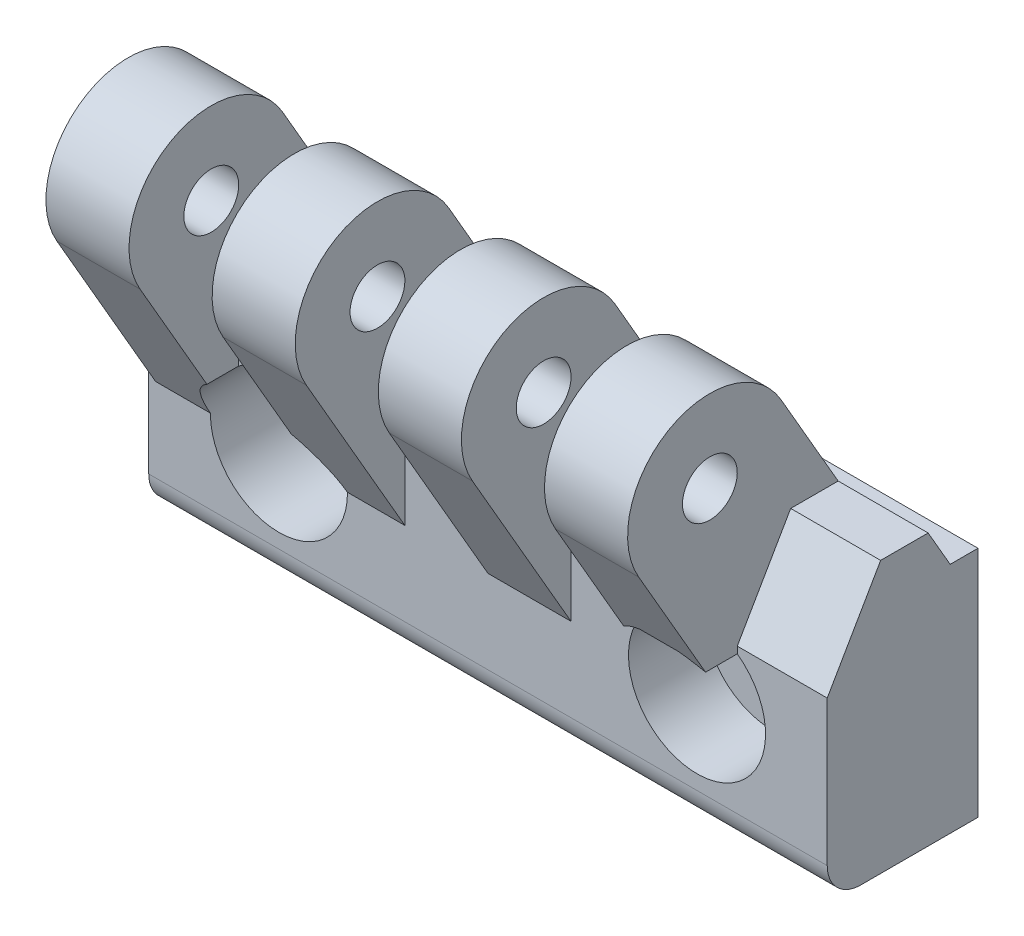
ISO-10303-21;
HEADER;
FILE_DESCRIPTION(('STEP AP214'),'2;1');
FILE_NAME('part.step','',(''),(''),'','','');
FILE_SCHEMA(('AUTOMOTIVE_DESIGN { 1 0 10303 214 1 1 1 1 }'));
ENDSEC;
DATA;
#1=APPLICATION_CONTEXT('core data for automotive mechanical design processes');
#2=APPLICATION_PROTOCOL_DEFINITION('international standard','automotive_design',2000,#1);
#3=PRODUCT_CONTEXT('',#1,'mechanical');
#4=PRODUCT('Part','Part','',(#3));
#5=PRODUCT_RELATED_PRODUCT_CATEGORY('part','',(#4));
#6=PRODUCT_DEFINITION_FORMATION('','',#4);
#7=PRODUCT_DEFINITION_CONTEXT('part definition',#1,'design');
#8=PRODUCT_DEFINITION('design','',#6,#7);
#9=PRODUCT_DEFINITION_SHAPE('','',#8);
#10=(LENGTH_UNIT() NAMED_UNIT(*) SI_UNIT(.MILLI.,.METRE.));
#11=(NAMED_UNIT(*) PLANE_ANGLE_UNIT() SI_UNIT($,.RADIAN.));
#12=(NAMED_UNIT(*) SI_UNIT($,.STERADIAN.) SOLID_ANGLE_UNIT());
#13=UNCERTAINTY_MEASURE_WITH_UNIT(LENGTH_MEASURE(1.E-05),#10,'distance_accuracy_value','');
#14=(GEOMETRIC_REPRESENTATION_CONTEXT(3) GLOBAL_UNCERTAINTY_ASSIGNED_CONTEXT((#13)) GLOBAL_UNIT_ASSIGNED_CONTEXT((#10,
#11,#12)) REPRESENTATION_CONTEXT('',''));
#15=CARTESIAN_POINT('',(0.,0.,0.));
#16=DIRECTION('',(0.,0.,1.));
#17=DIRECTION('',(1.,0.,0.));
#18=AXIS2_PLACEMENT_3D('',#15,#16,#17);
#19=CARTESIAN_POINT('',(40.,4.53553018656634,11.));
#20=DIRECTION('',(0.,0.,-1.));
#21=DIRECTION('',(-1.,0.,0.));
#22=AXIS2_PLACEMENT_3D('',#19,#20,#21);
#23=PLANE('',#22);
#24=CARTESIAN_POINT('',(0.,0.,11.));
#25=DIRECTION('',(0.,0.,-1.));
#26=DIRECTION('',(-1.,0.,0.));
#27=AXIS2_PLACEMENT_3D('',#24,#25,#26);
#28=CIRCLE('',#27,5.);
#29=CARTESIAN_POINT('',(3.125,3.903123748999,11.));
#30=VERTEX_POINT('',#29);
#31=CARTESIAN_POINT('',(2.10451085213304,4.53553018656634,11.));
#32=VERTEX_POINT('',#31);
#33=EDGE_CURVE('E1015',#30,#32,#28,.F.);
#34=ORIENTED_EDGE('',*,*,#33,.F.);
#35=DIRECTION('',(0.,-1.,0.));
#36=VECTOR('',#35,1.);
#37=CARTESIAN_POINT('',(3.125,4.53553018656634,11.));
#38=LINE('',#37,#36);
#39=CARTESIAN_POINT('',(3.125,4.53553018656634,11.));
#40=VERTEX_POINT('',#39);
#41=EDGE_CURVE('E461',#40,#30,#38,.T.);
#42=ORIENTED_EDGE('',*,*,#41,.F.);
#43=DIRECTION('',(-1.,0.,0.));
#44=VECTOR('',#43,1.);
#45=CARTESIAN_POINT('',(40.,4.53553018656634,11.));
#46=LINE('',#45,#44);
#47=EDGE_CURVE('E560',#40,#32,#46,.T.);
#48=ORIENTED_EDGE('',*,*,#47,.T.);
#49=EDGE_LOOP('',(#34,#42,#48));
#50=FACE_BOUND('',#49,.T.);
#51=ADVANCED_FACE('F14',(#50),#23,.F.);
#52=CARTESIAN_POINT('',(-2.104510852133,4.53553018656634,11.));
#53=VERTEX_POINT('',#52);
#54=CARTESIAN_POINT('',(-2.9375,4.04612082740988,11.));
#55=VERTEX_POINT('',#54);
#56=EDGE_CURVE('E29',#53,#55,#28,.F.);
#57=ORIENTED_EDGE('',*,*,#56,.F.);
#58=CARTESIAN_POINT('',(-2.9375,4.53553018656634,11.));
#59=VERTEX_POINT('',#58);
#60=EDGE_CURVE('E424',#53,#59,#46,.T.);
#61=ORIENTED_EDGE('',*,*,#60,.T.);
#62=DIRECTION('',(0.,-1.,0.));
#63=VECTOR('',#62,1.);
#64=CARTESIAN_POINT('',(-2.9375,4.53553018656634,11.));
#65=LINE('',#64,#63);
#66=EDGE_CURVE('E288',#59,#55,#65,.T.);
#67=ORIENTED_EDGE('',*,*,#66,.T.);
#68=EDGE_LOOP('',(#57,#61,#67));
#69=FACE_BOUND('',#68,.T.);
#70=ADVANCED_FACE('F678',(#69),#23,.F.);
#71=CARTESIAN_POINT('',(3.125,15.5,13.));
#72=DIRECTION('',(1.,0.,0.));
#73=DIRECTION('',(0.,1.,0.));
#74=AXIS2_PLACEMENT_3D('',#71,#72,#73);
#75=PLANE('',#74);
#76=CARTESIAN_POINT('',(3.125,15.5,13.));
#77=DIRECTION('',(1.,0.,0.));
#78=DIRECTION('',(0.,1.,0.));
#79=AXIS2_PLACEMENT_3D('',#76,#77,#78);
#80=CIRCLE('',#79,2.);
#81=CARTESIAN_POINT('',(3.125,17.5,13.));
#82=VERTEX_POINT('',#81);
#83=EDGE_CURVE('E313',#82,#82,#80,.T.);
#84=ORIENTED_EDGE('',*,*,#83,.T.);
#85=EDGE_LOOP('',(#84));
#86=FACE_BOUND('',#85,.T.);
#87=DIRECTION('',(0.,0.,-1.));
#88=VECTOR('',#87,1.);
#89=CARTESIAN_POINT('',(3.125,3.903123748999,0.));
#90=LINE('',#89,#88);
#91=CARTESIAN_POINT('',(3.125,3.903123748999,13.2327436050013));
#92=VERTEX_POINT('',#91);
#93=EDGE_CURVE('E652',#92,#30,#90,.T.);
#94=ORIENTED_EDGE('',*,*,#93,.F.);
#95=DIRECTION('',(0.,-0.866025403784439,-0.5));
#96=VECTOR('',#95,1.);
#97=CARTESIAN_POINT('',(3.125,12.5,18.1961524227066));
#98=LINE('',#97,#96);
#99=CARTESIAN_POINT('',(3.125,12.5,18.1961524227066));
#100=VERTEX_POINT('',#99);
#101=EDGE_CURVE('E310',#100,#92,#98,.T.);
#102=ORIENTED_EDGE('',*,*,#101,.F.);
#103=CARTESIAN_POINT('',(3.125,15.5,13.));
#104=DIRECTION('',(1.,0.,0.));
#105=DIRECTION('',(0.,1.,0.));
#106=AXIS2_PLACEMENT_3D('',#103,#104,#105);
#107=CIRCLE('',#106,6.);
#108=CARTESIAN_POINT('',(3.125,18.5,7.80384757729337));
#109=VERTEX_POINT('',#108);
#110=EDGE_CURVE('E306',#109,#100,#107,.T.);
#111=ORIENTED_EDGE('',*,*,#110,.F.);
#112=DIRECTION('',(0.,0.866025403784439,0.5));
#113=VECTOR('',#112,1.);
#114=CARTESIAN_POINT('',(3.125,6.71539030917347,1.));
#115=LINE('',#114,#113);
#116=CARTESIAN_POINT('',(3.125,11.2857142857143,3.63867777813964));
#117=VERTEX_POINT('',#116);
#118=EDGE_CURVE('E304',#117,#109,#115,.T.);
#119=ORIENTED_EDGE('',*,*,#118,.F.);
#120=DIRECTION('',(0.,0.,1.));
#121=VECTOR('',#120,1.);
#122=CARTESIAN_POINT('',(3.125,11.2857142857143,3.63867777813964));
#123=LINE('',#122,#121);
#124=CARTESIAN_POINT('',(3.125,11.2857142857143,7.1027793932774));
#125=VERTEX_POINT('',#124);
#126=EDGE_CURVE('E337',#117,#125,#123,.T.);
#127=ORIENTED_EDGE('',*,*,#126,.T.);
#128=DIRECTION('',(0.,-0.866025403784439,0.5));
#129=VECTOR('',#128,1.);
#130=CARTESIAN_POINT('',(3.125,11.2857142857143,7.1027793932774));
#131=LINE('',#130,#129);
#132=EDGE_CURVE('E335',#125,#40,#131,.T.);
#133=ORIENTED_EDGE('',*,*,#132,.T.);
#134=ORIENTED_EDGE('',*,*,#41,.T.);
#135=EDGE_LOOP('',(#94,#102,#111,#119,#127,#133,#134));
#136=FACE_BOUND('',#135,.T.);
#137=ADVANCED_FACE('F651',(#86,#136),#75,.F.);
#138=CARTESIAN_POINT('',(-2.9375,15.5,13.));
#139=DIRECTION('',(1.,0.,0.));
#140=DIRECTION('',(0.,1.,0.));
#141=AXIS2_PLACEMENT_3D('',#138,#139,#140);
#142=PLANE('',#141);
#143=CARTESIAN_POINT('',(-2.9375,15.5,13.));
#144=DIRECTION('',(1.,0.,0.));
#145=DIRECTION('',(0.,1.,0.));
#146=AXIS2_PLACEMENT_3D('',#143,#144,#145);
#147=CIRCLE('',#146,2.);
#148=CARTESIAN_POINT('',(-2.9375,17.5,13.));
#149=VERTEX_POINT('',#148);
#150=EDGE_CURVE('E273',#149,#149,#147,.T.);
#151=ORIENTED_EDGE('',*,*,#150,.F.);
#152=EDGE_LOOP('',(#151));
#153=FACE_BOUND('',#152,.T.);
#154=DIRECTION('',(0.,-0.866025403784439,-0.5));
#155=VECTOR('',#154,1.);
#156=CARTESIAN_POINT('',(-2.9375,12.5,18.1961524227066));
#157=LINE('',#156,#155);
#158=CARTESIAN_POINT('',(-2.9375,12.5,18.1961524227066));
#159=VERTEX_POINT('',#158);
#160=CARTESIAN_POINT('',(-2.9375,4.04612082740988,13.3153030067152));
#161=VERTEX_POINT('',#160);
#162=EDGE_CURVE('E263',#159,#161,#157,.T.);
#163=ORIENTED_EDGE('',*,*,#162,.T.);
#164=DIRECTION('',(0.,0.,-1.));
#165=VECTOR('',#164,1.);
#166=CARTESIAN_POINT('',(-2.9375,4.04612082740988,0.));
#167=LINE('',#166,#165);
#168=EDGE_CURVE('E9',#161,#55,#167,.T.);
#169=ORIENTED_EDGE('',*,*,#168,.T.);
#170=ORIENTED_EDGE('',*,*,#66,.F.);
#171=DIRECTION('',(0.,-0.866025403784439,0.5));
#172=VECTOR('',#171,1.);
#173=CARTESIAN_POINT('',(-2.9375,11.2857142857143,7.1027793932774));
#174=LINE('',#173,#172);
#175=CARTESIAN_POINT('',(-2.9375,11.2857142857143,7.1027793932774));
#176=VERTEX_POINT('',#175);
#177=EDGE_CURVE('E290',#176,#59,#174,.T.);
#178=ORIENTED_EDGE('',*,*,#177,.F.);
#179=DIRECTION('',(0.,0.,1.));
#180=VECTOR('',#179,1.);
#181=CARTESIAN_POINT('',(-2.9375,11.2857142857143,3.63867777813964));
#182=LINE('',#181,#180);
#183=CARTESIAN_POINT('',(-2.9375,11.2857142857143,3.63867777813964));
#184=VERTEX_POINT('',#183);
#185=EDGE_CURVE('E293',#184,#176,#182,.T.);
#186=ORIENTED_EDGE('',*,*,#185,.F.);
#187=DIRECTION('',(0.,0.866025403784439,0.5));
#188=VECTOR('',#187,1.);
#189=CARTESIAN_POINT('',(-2.9375,6.71539030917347,1.));
#190=LINE('',#189,#188);
#191=CARTESIAN_POINT('',(-2.9375,18.5,7.80384757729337));
#192=VERTEX_POINT('',#191);
#193=EDGE_CURVE('E278',#184,#192,#190,.T.);
#194=ORIENTED_EDGE('',*,*,#193,.T.);
#195=CARTESIAN_POINT('',(-2.9375,15.5,13.));
#196=DIRECTION('',(1.,0.,0.));
#197=DIRECTION('',(0.,1.,0.));
#198=AXIS2_PLACEMENT_3D('',#195,#196,#197);
#199=CIRCLE('',#198,6.);
#200=EDGE_CURVE('E272',#192,#159,#199,.T.);
#201=ORIENTED_EDGE('',*,*,#200,.T.);
#202=EDGE_LOOP('',(#163,#169,#170,#178,#186,#194,#201));
#203=FACE_BOUND('',#202,.T.);
#204=ADVANCED_FACE('F270',(#153,#203),#142,.T.);
#205=CARTESIAN_POINT('',(33.4375,15.5,13.));
#206=DIRECTION('',(1.,0.,0.));
#207=DIRECTION('',(0.,1.,0.));
#208=AXIS2_PLACEMENT_3D('',#205,#206,#207);
#209=PLANE('',#208);
#210=CARTESIAN_POINT('',(33.4375,15.5,13.));
#211=DIRECTION('',(1.,0.,0.));
#212=DIRECTION('',(0.,1.,0.));
#213=AXIS2_PLACEMENT_3D('',#210,#211,#212);
#214=CIRCLE('',#213,2.);
#215=CARTESIAN_POINT('',(33.4375,17.5,13.));
#216=VERTEX_POINT('',#215);
#217=EDGE_CURVE('E508',#216,#216,#214,.T.);
#218=ORIENTED_EDGE('',*,*,#217,.F.);
#219=EDGE_LOOP('',(#218));
#220=FACE_BOUND('',#219,.T.);
#221=DIRECTION('',(0.,-0.866025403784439,-0.5));
#222=VECTOR('',#221,1.);
#223=CARTESIAN_POINT('',(33.4375,12.5,18.1961524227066));
#224=LINE('',#223,#222);
#225=CARTESIAN_POINT('',(33.4375,12.5,18.1961524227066));
#226=VERTEX_POINT('',#225);
#227=CARTESIAN_POINT('',(33.4375,4.04612082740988,13.3153030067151));
#228=VERTEX_POINT('',#227);
#229=EDGE_CURVE('E506',#226,#228,#224,.T.);
#230=ORIENTED_EDGE('',*,*,#229,.T.);
#231=DIRECTION('',(0.,0.,-1.));
#232=VECTOR('',#231,1.);
#233=CARTESIAN_POINT('',(33.4375,4.04612082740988,0.));
#234=LINE('',#233,#232);
#235=CARTESIAN_POINT('',(33.4375,4.04612082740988,11.));
#236=VERTEX_POINT('',#235);
#237=EDGE_CURVE('E489',#228,#236,#234,.T.);
#238=ORIENTED_EDGE('',*,*,#237,.T.);
#239=DIRECTION('',(0.,-1.,0.));
#240=VECTOR('',#239,1.);
#241=CARTESIAN_POINT('',(33.4375,4.53553018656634,11.));
#242=LINE('',#241,#240);
#243=CARTESIAN_POINT('',(33.4375,4.53553018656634,11.));
#244=VERTEX_POINT('',#243);
#245=EDGE_CURVE('E528',#244,#236,#242,.T.);
#246=ORIENTED_EDGE('',*,*,#245,.F.);
#247=DIRECTION('',(0.,-0.866025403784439,0.5));
#248=VECTOR('',#247,1.);
#249=CARTESIAN_POINT('',(33.4375,11.2857142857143,7.1027793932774));
#250=LINE('',#249,#248);
#251=CARTESIAN_POINT('',(33.4375,11.2857142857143,7.1027793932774));
#252=VERTEX_POINT('',#251);
#253=EDGE_CURVE('E468',#252,#244,#250,.T.);
#254=ORIENTED_EDGE('',*,*,#253,.F.);
#255=DIRECTION('',(0.,0.,1.));
#256=VECTOR('',#255,1.);
#257=CARTESIAN_POINT('',(33.4375,11.2857142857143,3.63867777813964));
#258=LINE('',#257,#256);
#259=CARTESIAN_POINT('',(33.4375,11.2857142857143,3.63867777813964));
#260=VERTEX_POINT('',#259);
#261=EDGE_CURVE('E526',#260,#252,#258,.T.);
#262=ORIENTED_EDGE('',*,*,#261,.F.);
#263=DIRECTION('',(0.,0.866025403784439,0.5));
#264=VECTOR('',#263,1.);
#265=CARTESIAN_POINT('',(33.4375,6.71539030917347,1.));
#266=LINE('',#265,#264);
#267=CARTESIAN_POINT('',(33.4375,18.5,7.80384757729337));
#268=VERTEX_POINT('',#267);
#269=EDGE_CURVE('E501',#260,#268,#266,.T.);
#270=ORIENTED_EDGE('',*,*,#269,.T.);
#271=CARTESIAN_POINT('',(33.4375,15.5,13.));
#272=DIRECTION('',(1.,0.,0.));
#273=DIRECTION('',(0.,1.,0.));
#274=AXIS2_PLACEMENT_3D('',#271,#272,#273);
#275=CIRCLE('',#274,6.);
#276=EDGE_CURVE('E503',#268,#226,#275,.T.);
#277=ORIENTED_EDGE('',*,*,#276,.T.);
#278=EDGE_LOOP('',(#230,#238,#246,#254,#262,#270,#277));
#279=FACE_BOUND('',#278,.T.);
#280=ADVANCED_FACE('F606',(#220,#279),#209,.T.);
#281=CARTESIAN_POINT('',(27.375,15.5,13.));
#282=DIRECTION('',(1.,0.,0.));
#283=DIRECTION('',(0.,1.,0.));
#284=AXIS2_PLACEMENT_3D('',#281,#282,#283);
#285=PLANE('',#284);
#286=CARTESIAN_POINT('',(27.375,15.5,13.));
#287=DIRECTION('',(1.,0.,0.));
#288=DIRECTION('',(0.,1.,0.));
#289=AXIS2_PLACEMENT_3D('',#286,#287,#288);
#290=CIRCLE('',#289,2.);
#291=CARTESIAN_POINT('',(27.375,17.5,13.));
#292=VERTEX_POINT('',#291);
#293=EDGE_CURVE('E504',#292,#292,#290,.T.);
#294=ORIENTED_EDGE('',*,*,#293,.T.);
#295=EDGE_LOOP('',(#294));
#296=FACE_BOUND('',#295,.T.);
#297=DIRECTION('',(0.,0.,-1.));
#298=VECTOR('',#297,1.);
#299=CARTESIAN_POINT('',(27.375,3.903123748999,0.));
#300=LINE('',#299,#298);
#301=CARTESIAN_POINT('',(27.375,3.903123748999,13.2327436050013));
#302=VERTEX_POINT('',#301);
#303=CARTESIAN_POINT('',(27.375,3.903123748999,11.));
#304=VERTEX_POINT('',#303);
#305=EDGE_CURVE('E470',#302,#304,#300,.T.);
#306=ORIENTED_EDGE('',*,*,#305,.F.);
#307=DIRECTION('',(0.,-0.866025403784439,-0.5));
#308=VECTOR('',#307,1.);
#309=CARTESIAN_POINT('',(27.375,12.5,18.1961524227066));
#310=LINE('',#309,#308);
#311=CARTESIAN_POINT('',(27.375,12.5,18.1961524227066));
#312=VERTEX_POINT('',#311);
#313=EDGE_CURVE('E486',#312,#302,#310,.T.);
#314=ORIENTED_EDGE('',*,*,#313,.F.);
#315=CARTESIAN_POINT('',(27.375,15.5,13.));
#316=DIRECTION('',(1.,0.,0.));
#317=DIRECTION('',(0.,1.,0.));
#318=AXIS2_PLACEMENT_3D('',#315,#316,#317);
#319=CIRCLE('',#318,6.);
#320=CARTESIAN_POINT('',(27.375,18.5,7.80384757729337));
#321=VERTEX_POINT('',#320);
#322=EDGE_CURVE('E492',#321,#312,#319,.T.);
#323=ORIENTED_EDGE('',*,*,#322,.F.);
#324=DIRECTION('',(0.,0.866025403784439,0.5));
#325=VECTOR('',#324,1.);
#326=CARTESIAN_POINT('',(27.375,6.71539030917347,1.));
#327=LINE('',#326,#325);
#328=CARTESIAN_POINT('',(27.375,11.2857142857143,3.63867777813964));
#329=VERTEX_POINT('',#328);
#330=EDGE_CURVE('E491',#329,#321,#327,.T.);
#331=ORIENTED_EDGE('',*,*,#330,.F.);
#332=DIRECTION('',(0.,0.,1.));
#333=VECTOR('',#332,1.);
#334=CARTESIAN_POINT('',(27.375,11.2857142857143,3.63867777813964));
#335=LINE('',#334,#333);
#336=CARTESIAN_POINT('',(27.375,11.2857142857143,7.1027793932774));
#337=VERTEX_POINT('',#336);
#338=EDGE_CURVE('E520',#329,#337,#335,.T.);
#339=ORIENTED_EDGE('',*,*,#338,.T.);
#340=DIRECTION('',(0.,-0.866025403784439,0.5));
#341=VECTOR('',#340,1.);
#342=CARTESIAN_POINT('',(27.375,11.2857142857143,7.1027793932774));
#343=LINE('',#342,#341);
#344=CARTESIAN_POINT('',(27.375,4.53553018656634,11.));
#345=VERTEX_POINT('',#344);
#346=EDGE_CURVE('E465',#337,#345,#343,.T.);
#347=ORIENTED_EDGE('',*,*,#346,.T.);
#348=DIRECTION('',(0.,-1.,0.));
#349=VECTOR('',#348,1.);
#350=CARTESIAN_POINT('',(27.375,4.53553018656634,11.));
#351=LINE('',#350,#349);
#352=EDGE_CURVE('E523',#345,#304,#351,.T.);
#353=ORIENTED_EDGE('',*,*,#352,.T.);
#354=EDGE_LOOP('',(#306,#314,#323,#331,#339,#347,#353));
#355=FACE_BOUND('',#354,.T.);
#356=ADVANCED_FACE('F623',(#296,#355),#285,.F.);
#357=CARTESIAN_POINT('',(40.,11.2857142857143,3.63867777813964));
#358=DIRECTION('',(0.,-1.,0.));
#359=DIRECTION('',(0.,0.,-1.));
#360=AXIS2_PLACEMENT_3D('',#357,#358,#359);
#361=PLANE('',#360);
#362=ORIENTED_EDGE('',*,*,#338,.F.);
#363=DIRECTION('',(-1.,0.,0.));
#364=VECTOR('',#363,1.);
#365=CARTESIAN_POINT('',(40.,11.2857142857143,3.63867777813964));
#366=LINE('',#365,#364);
#367=CARTESIAN_POINT('',(21.3125,11.2857142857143,3.63867777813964));
#368=VERTEX_POINT('',#367);
#369=EDGE_CURVE('E435',#329,#368,#366,.T.);
#370=ORIENTED_EDGE('',*,*,#369,.T.);
#371=DIRECTION('',(0.,0.,1.));
#372=VECTOR('',#371,1.);
#373=CARTESIAN_POINT('',(21.3125,11.2857142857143,3.63867777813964));
#374=LINE('',#373,#372);
#375=CARTESIAN_POINT('',(21.3125,11.2857142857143,7.1027793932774));
#376=VERTEX_POINT('',#375);
#377=EDGE_CURVE('E374',#368,#376,#374,.T.);
#378=ORIENTED_EDGE('',*,*,#377,.T.);
#379=DIRECTION('',(-1.,0.,0.));
#380=VECTOR('',#379,1.);
#381=CARTESIAN_POINT('',(40.,11.2857142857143,7.1027793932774));
#382=LINE('',#381,#380);
#383=EDGE_CURVE('E430',#337,#376,#382,.T.);
#384=ORIENTED_EDGE('',*,*,#383,.F.);
#385=EDGE_LOOP('',(#362,#370,#378,#384));
#386=FACE_BOUND('',#385,.T.);
#387=ADVANCED_FACE('F629',(#386),#361,.F.);
#388=CARTESIAN_POINT('',(40.,11.2857142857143,7.1027793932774));
#389=DIRECTION('',(0.,-0.5,-0.866025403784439));
#390=DIRECTION('',(0.,0.866025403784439,-0.5));
#391=AXIS2_PLACEMENT_3D('',#388,#389,#390);
#392=PLANE('',#391);
#393=ORIENTED_EDGE('',*,*,#346,.F.);
#394=ORIENTED_EDGE('',*,*,#383,.T.);
#395=DIRECTION('',(0.,-0.866025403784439,0.5));
#396=VECTOR('',#395,1.);
#397=CARTESIAN_POINT('',(21.3125,11.2857142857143,7.1027793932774));
#398=LINE('',#397,#396);
#399=CARTESIAN_POINT('',(21.3125,4.53553018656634,11.));
#400=VERTEX_POINT('',#399);
#401=EDGE_CURVE('E371',#376,#400,#398,.T.);
#402=ORIENTED_EDGE('',*,*,#401,.T.);
#403=EDGE_CURVE('E423',#345,#400,#46,.T.);
#404=ORIENTED_EDGE('',*,*,#403,.F.);
#405=EDGE_LOOP('',(#393,#394,#402,#404));
#406=FACE_BOUND('',#405,.T.);
#407=ADVANCED_FACE('F627',(#406),#392,.F.);
#408=DIRECTION('',(0.,0.,1.));
#409=VECTOR('',#408,1.);
#410=CARTESIAN_POINT('',(-9.,11.2857142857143,3.63867777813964));
#411=LINE('',#410,#409);
#412=CARTESIAN_POINT('',(-9.,11.2857142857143,3.63867777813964));
#413=VERTEX_POINT('',#412);
#414=CARTESIAN_POINT('',(-9.,11.2857142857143,7.1027793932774));
#415=VERTEX_POINT('',#414);
#416=EDGE_CURVE('E301',#413,#415,#411,.T.);
#417=ORIENTED_EDGE('',*,*,#416,.F.);
#418=CARTESIAN_POINT('',(-9.5,11.2857142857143,3.63867777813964));
#419=VERTEX_POINT('',#418);
#420=EDGE_CURVE('E429',#413,#419,#366,.T.);
#421=ORIENTED_EDGE('',*,*,#420,.T.);
#422=DIRECTION('',(0.,0.,1.));
#423=VECTOR('',#422,1.);
#424=CARTESIAN_POINT('',(-9.5,11.2857142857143,3.63867777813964));
#425=LINE('',#424,#423);
#426=CARTESIAN_POINT('',(-9.5,11.2857142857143,7.1027793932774));
#427=VERTEX_POINT('',#426);
#428=EDGE_CURVE('E409',#419,#427,#425,.T.);
#429=ORIENTED_EDGE('',*,*,#428,.T.);
#430=EDGE_CURVE('E422',#415,#427,#382,.T.);
#431=ORIENTED_EDGE('',*,*,#430,.F.);
#432=EDGE_LOOP('',(#417,#421,#429,#431));
#433=FACE_BOUND('',#432,.T.);
#434=ADVANCED_FACE('F585',(#433),#361,.F.);
#435=DIRECTION('',(0.,-0.866025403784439,0.5));
#436=VECTOR('',#435,1.);
#437=CARTESIAN_POINT('',(-9.,11.2857142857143,7.1027793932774));
#438=LINE('',#437,#436);
#439=CARTESIAN_POINT('',(-9.,4.53553018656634,11.));
#440=VERTEX_POINT('',#439);
#441=EDGE_CURVE('E299',#415,#440,#438,.T.);
#442=ORIENTED_EDGE('',*,*,#441,.F.);
#443=ORIENTED_EDGE('',*,*,#430,.T.);
#444=DIRECTION('',(0.,-0.866025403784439,0.5));
#445=VECTOR('',#444,1.);
#446=CARTESIAN_POINT('',(-9.5,11.2857142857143,7.1027793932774));
#447=LINE('',#446,#445);
#448=CARTESIAN_POINT('',(-9.5,4.53553018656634,11.));
#449=VERTEX_POINT('',#448);
#450=EDGE_CURVE('E412',#427,#449,#447,.T.);
#451=ORIENTED_EDGE('',*,*,#450,.T.);
#452=EDGE_CURVE('E418',#440,#449,#46,.T.);
#453=ORIENTED_EDGE('',*,*,#452,.F.);
#454=EDGE_LOOP('',(#442,#443,#451,#453));
#455=FACE_BOUND('',#454,.T.);
#456=ADVANCED_FACE('F556',(#455),#392,.F.);
#457=DIRECTION('',(-1.,0.,0.));
#458=VECTOR('',#457,1.);
#459=CARTESIAN_POINT('',(40.,0.0358983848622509,11.));
#460=LINE('',#459,#458);
#461=CARTESIAN_POINT('',(9.1875,0.0358983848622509,11.));
#462=VERTEX_POINT('',#461);
#463=CARTESIAN_POINT('',(4.99987112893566,0.0358983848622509,11.));
#464=VERTEX_POINT('',#463);
#465=EDGE_CURVE('E458',#462,#464,#460,.T.);
#466=ORIENTED_EDGE('',*,*,#465,.T.);
#467=CARTESIAN_POINT('',(-4.99987112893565,0.0358983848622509,11.));
#468=VERTEX_POINT('',#467);
#469=EDGE_CURVE('E267',#468,#464,#28,.F.);
#470=ORIENTED_EDGE('',*,*,#469,.F.);
#471=DIRECTION('',(-1.,0.,0.));
#472=VECTOR('',#471,1.);
#473=CARTESIAN_POINT('',(40.,0.0358983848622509,11.));
#474=LINE('',#473,#472);
#475=CARTESIAN_POINT('',(-9.,0.0358983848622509,11.));
#476=VERTEX_POINT('',#475);
#477=EDGE_CURVE('E266',#468,#476,#474,.T.);
#478=ORIENTED_EDGE('',*,*,#477,.T.);
#479=DIRECTION('',(0.,-1.,0.));
#480=VECTOR('',#479,1.);
#481=CARTESIAN_POINT('',(-9.,4.53553018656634,11.));
#482=LINE('',#481,#480);
#483=EDGE_CURVE('E296',#440,#476,#482,.T.);
#484=ORIENTED_EDGE('',*,*,#483,.F.);
#485=ORIENTED_EDGE('',*,*,#452,.T.);
#486=DIRECTION('',(0.,-1.,0.));
#487=VECTOR('',#486,1.);
#488=CARTESIAN_POINT('',(-9.5,4.53553018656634,11.));
#489=LINE('',#488,#487);
#490=CARTESIAN_POINT('',(-9.5,-6.05555555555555,11.));
#491=VERTEX_POINT('',#490);
#492=EDGE_CURVE('E382',#449,#491,#489,.T.);
#493=ORIENTED_EDGE('',*,*,#492,.T.);
#494=DIRECTION('',(-1.,0.,0.));
#495=VECTOR('',#494,1.);
#496=CARTESIAN_POINT('',(40.,-6.05555555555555,11.));
#497=LINE('',#496,#495);
#498=CARTESIAN_POINT('',(40.,-6.05555555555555,11.));
#499=VERTEX_POINT('',#498);
#500=EDGE_CURVE('E396',#499,#491,#497,.T.);
#501=ORIENTED_EDGE('',*,*,#500,.F.);
#502=DIRECTION('',(0.,-1.,0.));
#503=VECTOR('',#502,1.);
#504=CARTESIAN_POINT('',(40.,4.53553018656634,11.));
#505=LINE('',#504,#503);
#506=CARTESIAN_POINT('',(40.,4.53553018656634,11.));
#507=VERTEX_POINT('',#506);
#508=EDGE_CURVE('E394',#507,#499,#505,.T.);
#509=ORIENTED_EDGE('',*,*,#508,.F.);
#510=EDGE_CURVE('E419',#507,#244,#46,.T.);
#511=ORIENTED_EDGE('',*,*,#510,.T.);
#512=ORIENTED_EDGE('',*,*,#245,.T.);
#513=CARTESIAN_POINT('',(30.5,0.,11.));
#514=DIRECTION('',(0.,0.,-1.));
#515=DIRECTION('',(-1.,0.,0.));
#516=AXIS2_PLACEMENT_3D('',#513,#514,#515);
#517=CIRCLE('',#516,5.);
#518=EDGE_CURVE('E487',#304,#236,#517,.F.);
#519=ORIENTED_EDGE('',*,*,#518,.F.);
#520=ORIENTED_EDGE('',*,*,#352,.F.);
#521=ORIENTED_EDGE('',*,*,#403,.T.);
#522=DIRECTION('',(0.,-1.,0.));
#523=VECTOR('',#522,1.);
#524=CARTESIAN_POINT('',(21.3125,4.53553018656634,11.));
#525=LINE('',#524,#523);
#526=CARTESIAN_POINT('',(21.3125,0.0358983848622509,11.));
#527=VERTEX_POINT('',#526);
#528=EDGE_CURVE('E453',#400,#527,#525,.T.);
#529=ORIENTED_EDGE('',*,*,#528,.T.);
#530=DIRECTION('',(1.,0.,0.));
#531=VECTOR('',#530,1.);
#532=CARTESIAN_POINT('',(40.,0.0358983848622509,11.));
#533=LINE('',#532,#531);
#534=CARTESIAN_POINT('',(15.25,0.0358983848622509,11.));
#535=VERTEX_POINT('',#534);
#536=EDGE_CURVE('E450',#535,#527,#533,.T.);
#537=ORIENTED_EDGE('',*,*,#536,.F.);
#538=DIRECTION('',(0.,-1.,0.));
#539=VECTOR('',#538,1.);
#540=CARTESIAN_POINT('',(15.25,4.53553018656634,11.));
#541=LINE('',#540,#539);
#542=CARTESIAN_POINT('',(15.25,4.53553018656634,11.));
#543=VERTEX_POINT('',#542);
#544=EDGE_CURVE('E447',#543,#535,#541,.T.);
#545=ORIENTED_EDGE('',*,*,#544,.F.);
#546=CARTESIAN_POINT('',(9.1875,4.53553018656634,11.));
#547=VERTEX_POINT('',#546);
#548=EDGE_CURVE('E425',#543,#547,#46,.T.);
#549=ORIENTED_EDGE('',*,*,#548,.T.);
#550=DIRECTION('',(0.,-1.,0.));
#551=VECTOR('',#550,1.);
#552=CARTESIAN_POINT('',(9.1875,4.53553018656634,11.));
#553=LINE('',#552,#551);
#554=EDGE_CURVE('E455',#547,#462,#553,.T.);
#555=ORIENTED_EDGE('',*,*,#554,.T.);
#556=EDGE_LOOP('',(#466,#470,#478,#484,#485,#493,#501,#509,#511,#512,#519,#520,#521,#529,#537,
#545,#549,#555));
#557=FACE_BOUND('',#556,.T.);
#558=ADVANCED_FACE('F554',(#557),#23,.F.);
#559=EDGE_CURVE('E580',#117,#184,#366,.T.);
#560=ORIENTED_EDGE('',*,*,#559,.T.);
#561=ORIENTED_EDGE('',*,*,#185,.T.);
#562=EDGE_CURVE('E633',#125,#176,#382,.T.);
#563=ORIENTED_EDGE('',*,*,#562,.F.);
#564=ORIENTED_EDGE('',*,*,#126,.F.);
#565=EDGE_LOOP('',(#560,#561,#563,#564));
#566=FACE_BOUND('',#565,.T.);
#567=ADVANCED_FACE('F642',(#566),#361,.F.);
#568=CARTESIAN_POINT('',(0.,0.,13.6185895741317));
#569=DIRECTION('',(0.,-0.5,-0.866025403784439));
#570=DIRECTION('',(0.,0.866025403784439,-0.5));
#571=AXIS2_PLACEMENT_3D('',#568,#569,#570);
#572=ELLIPSE('',#571,5.77350269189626,5.);
#573=EDGE_CURVE('E1017',#32,#53,#572,.F.);
#574=ORIENTED_EDGE('',*,*,#573,.F.);
#575=ORIENTED_EDGE('',*,*,#47,.F.);
#576=ORIENTED_EDGE('',*,*,#132,.F.);
#577=ORIENTED_EDGE('',*,*,#562,.T.);
#578=ORIENTED_EDGE('',*,*,#177,.T.);
#579=ORIENTED_EDGE('',*,*,#60,.F.);
#580=EDGE_LOOP('',(#574,#575,#576,#577,#578,#579));
#581=FACE_BOUND('',#580,.T.);
#582=ADVANCED_FACE('F639',(#581),#392,.F.);
#583=CARTESIAN_POINT('',(15.25,11.2857142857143,3.63867777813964));
#584=VERTEX_POINT('',#583);
#585=CARTESIAN_POINT('',(9.1875,11.2857142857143,3.63867777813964));
#586=VERTEX_POINT('',#585);
#587=EDGE_CURVE('E436',#584,#586,#366,.T.);
#588=ORIENTED_EDGE('',*,*,#587,.T.);
#589=DIRECTION('',(0.,0.,1.));
#590=VECTOR('',#589,1.);
#591=CARTESIAN_POINT('',(9.1875,11.2857142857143,3.63867777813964));
#592=LINE('',#591,#590);
#593=CARTESIAN_POINT('',(9.1875,11.2857142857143,7.1027793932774));
#594=VERTEX_POINT('',#593);
#595=EDGE_CURVE('E332',#586,#594,#592,.T.);
#596=ORIENTED_EDGE('',*,*,#595,.T.);
#597=CARTESIAN_POINT('',(15.25,11.2857142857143,7.1027793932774));
#598=VERTEX_POINT('',#597);
#599=EDGE_CURVE('E431',#598,#594,#382,.T.);
#600=ORIENTED_EDGE('',*,*,#599,.F.);
#601=DIRECTION('',(0.,0.,1.));
#602=VECTOR('',#601,1.);
#603=CARTESIAN_POINT('',(15.25,11.2857142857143,3.63867777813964));
#604=LINE('',#603,#602);
#605=EDGE_CURVE('E368',#584,#598,#604,.T.);
#606=ORIENTED_EDGE('',*,*,#605,.F.);
#607=EDGE_LOOP('',(#588,#596,#600,#606));
#608=FACE_BOUND('',#607,.T.);
#609=ADVANCED_FACE('F577',(#608),#361,.F.);
#610=ORIENTED_EDGE('',*,*,#599,.T.);
#611=DIRECTION('',(0.,-0.866025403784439,0.5));
#612=VECTOR('',#611,1.);
#613=CARTESIAN_POINT('',(9.1875,11.2857142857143,7.1027793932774));
#614=LINE('',#613,#612);
#615=EDGE_CURVE('E329',#594,#547,#614,.T.);
#616=ORIENTED_EDGE('',*,*,#615,.T.);
#617=ORIENTED_EDGE('',*,*,#548,.F.);
#618=DIRECTION('',(0.,-0.866025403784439,0.5));
#619=VECTOR('',#618,1.);
#620=CARTESIAN_POINT('',(15.25,11.2857142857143,7.1027793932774));
#621=LINE('',#620,#619);
#622=EDGE_CURVE('E365',#598,#543,#621,.T.);
#623=ORIENTED_EDGE('',*,*,#622,.F.);
#624=EDGE_LOOP('',(#610,#616,#617,#623));
#625=FACE_BOUND('',#624,.T.);
#626=ADVANCED_FACE('F567',(#625),#392,.F.);
#627=CARTESIAN_POINT('',(40.,-6.05555555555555,8.55555555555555));
#628=DIRECTION('',(-1.,0.,0.));
#629=DIRECTION('',(0.,-1.,0.));
#630=AXIS2_PLACEMENT_3D('',#627,#628,#629);
#631=CYLINDRICAL_SURFACE('',#630,2.44444444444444);
#632=CARTESIAN_POINT('',(-9.5,-6.05555555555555,8.55555555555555));
#633=DIRECTION('',(1.,0.,0.));
#634=DIRECTION('',(0.,1.,0.));
#635=AXIS2_PLACEMENT_3D('',#632,#633,#634);
#636=CIRCLE('',#635,2.44444444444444);
#637=CARTESIAN_POINT('',(-9.5,-8.5,8.55555555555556));
#638=VERTEX_POINT('',#637);
#639=EDGE_CURVE('E377',#491,#638,#636,.T.);
#640=ORIENTED_EDGE('',*,*,#639,.T.);
#641=DIRECTION('',(-1.,0.,0.));
#642=VECTOR('',#641,1.);
#643=CARTESIAN_POINT('',(40.,-8.5,8.55555555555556));
#644=LINE('',#643,#642);
#645=CARTESIAN_POINT('',(40.,-8.5,8.55555555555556));
#646=VERTEX_POINT('',#645);
#647=EDGE_CURVE('E444',#646,#638,#644,.T.);
#648=ORIENTED_EDGE('',*,*,#647,.F.);
#649=CARTESIAN_POINT('',(40.,-6.05555555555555,8.55555555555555));
#650=DIRECTION('',(1.,0.,0.));
#651=DIRECTION('',(0.,1.,0.));
#652=AXIS2_PLACEMENT_3D('',#649,#650,#651);
#653=CIRCLE('',#652,2.44444444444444);
#654=EDGE_CURVE('E378',#499,#646,#653,.T.);
#655=ORIENTED_EDGE('',*,*,#654,.F.);
#656=ORIENTED_EDGE('',*,*,#500,.T.);
#657=EDGE_LOOP('',(#640,#648,#655,#656));
#658=FACE_BOUND('',#657,.T.);
#659=ADVANCED_FACE('F16',(#658),#631,.T.);
#660=CARTESIAN_POINT('',(40.,-8.5,8.55555555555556));
#661=DIRECTION('',(0.,1.,0.));
#662=DIRECTION('',(-1.,0.,0.));
#663=AXIS2_PLACEMENT_3D('',#660,#661,#662);
#664=PLANE('',#663);
#665=DIRECTION('',(0.,0.,-1.));
#666=VECTOR('',#665,1.);
#667=CARTESIAN_POINT('',(-9.5,-8.5,8.55555555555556));
#668=LINE('',#667,#666);
#669=CARTESIAN_POINT('',(-9.5,-8.5,0.));
#670=VERTEX_POINT('',#669);
#671=EDGE_CURVE('E399',#638,#670,#668,.T.);
#672=ORIENTED_EDGE('',*,*,#671,.T.);
#673=DIRECTION('',(-1.,0.,0.));
#674=VECTOR('',#673,1.);
#675=CARTESIAN_POINT('',(40.,-8.5,0.));
#676=LINE('',#675,#674);
#677=CARTESIAN_POINT('',(40.,-8.5,0.));
#678=VERTEX_POINT('',#677);
#679=EDGE_CURVE('E441',#678,#670,#676,.T.);
#680=ORIENTED_EDGE('',*,*,#679,.F.);
#681=DIRECTION('',(0.,0.,-1.));
#682=VECTOR('',#681,1.);
#683=CARTESIAN_POINT('',(40.,-8.5,8.55555555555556));
#684=LINE('',#683,#682);
#685=EDGE_CURVE('E381',#646,#678,#684,.T.);
#686=ORIENTED_EDGE('',*,*,#685,.F.);
#687=ORIENTED_EDGE('',*,*,#647,.T.);
#688=EDGE_LOOP('',(#672,#680,#686,#687));
#689=FACE_BOUND('',#688,.T.);
#690=ADVANCED_FACE('F719',(#689),#664,.F.);
#691=CARTESIAN_POINT('',(40.,-8.5,0.));
#692=DIRECTION('',(0.,0.,1.));
#693=DIRECTION('',(1.,0.,0.));
#694=AXIS2_PLACEMENT_3D('',#691,#692,#693);
#695=PLANE('',#694);
#696=CARTESIAN_POINT('',(0.,0.,0.));
#697=DIRECTION('',(0.,0.,-1.));
#698=DIRECTION('',(-1.,0.,0.));
#699=AXIS2_PLACEMENT_3D('',#696,#697,#698);
#700=CIRCLE('',#699,2.75);
#701=CARTESIAN_POINT('',(-2.75,0.,0.));
#702=VERTEX_POINT('',#701);
#703=EDGE_CURVE('E1005',#702,#702,#700,.T.);
#704=ORIENTED_EDGE('',*,*,#703,.F.);
#705=EDGE_LOOP('',(#704));
#706=FACE_BOUND('',#705,.T.);
#707=CARTESIAN_POINT('',(30.5,0.,0.));
#708=DIRECTION('',(0.,0.,-1.));
#709=DIRECTION('',(-1.,0.,0.));
#710=AXIS2_PLACEMENT_3D('',#707,#708,#709);
#711=CIRCLE('',#710,2.75);
#712=CARTESIAN_POINT('',(27.75,0.,0.));
#713=VERTEX_POINT('',#712);
#714=EDGE_CURVE('E1020',#713,#713,#711,.T.);
#715=ORIENTED_EDGE('',*,*,#714,.F.);
#716=EDGE_LOOP('',(#715));
#717=FACE_BOUND('',#716,.T.);
#718=DIRECTION('',(0.,1.,0.));
#719=VECTOR('',#718,1.);
#720=CARTESIAN_POINT('',(-9.5,-8.5,0.));
#721=LINE('',#720,#719);
#722=CARTESIAN_POINT('',(-9.5,8.5,0.));
#723=VERTEX_POINT('',#722);
#724=EDGE_CURVE('E401',#670,#723,#721,.T.);
#725=ORIENTED_EDGE('',*,*,#724,.T.);
#726=DIRECTION('',(-1.,0.,0.));
#727=VECTOR('',#726,1.);
#728=CARTESIAN_POINT('',(40.,8.5,0.));
#729=LINE('',#728,#727);
#730=CARTESIAN_POINT('',(40.,8.5,0.));
#731=VERTEX_POINT('',#730);
#732=EDGE_CURVE('E438',#731,#723,#729,.T.);
#733=ORIENTED_EDGE('',*,*,#732,.F.);
#734=DIRECTION('',(0.,1.,0.));
#735=VECTOR('',#734,1.);
#736=CARTESIAN_POINT('',(40.,-8.5,0.));
#737=LINE('',#736,#735);
#738=EDGE_CURVE('E384',#678,#731,#737,.T.);
#739=ORIENTED_EDGE('',*,*,#738,.F.);
#740=ORIENTED_EDGE('',*,*,#679,.T.);
#741=EDGE_LOOP('',(#725,#733,#739,#740));
#742=FACE_BOUND('',#741,.T.);
#743=ADVANCED_FACE('F729',(#706,#717,#742),#695,.F.);
#744=CARTESIAN_POINT('',(40.,8.5,0.));
#745=DIRECTION('',(0.,-1.,0.));
#746=DIRECTION('',(1.,0.,0.));
#747=AXIS2_PLACEMENT_3D('',#744,#745,#746);
#748=PLANE('',#747);
#749=DIRECTION('',(0.,0.,1.));
#750=VECTOR('',#749,1.);
#751=CARTESIAN_POINT('',(-9.5,8.5,0.));
#752=LINE('',#751,#750);
#753=CARTESIAN_POINT('',(-9.5,8.5,2.03034488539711));
#754=VERTEX_POINT('',#753);
#755=EDGE_CURVE('E403',#723,#754,#752,.T.);
#756=ORIENTED_EDGE('',*,*,#755,.T.);
#757=DIRECTION('',(-1.,0.,0.));
#758=VECTOR('',#757,1.);
#759=CARTESIAN_POINT('',(40.,8.5,2.03034488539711));
#760=LINE('',#759,#758);
#761=CARTESIAN_POINT('',(40.,8.5,2.03034488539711));
#762=VERTEX_POINT('',#761);
#763=EDGE_CURVE('E434',#762,#754,#760,.T.);
#764=ORIENTED_EDGE('',*,*,#763,.F.);
#765=DIRECTION('',(0.,0.,1.));
#766=VECTOR('',#765,1.);
#767=CARTESIAN_POINT('',(40.,8.5,0.));
#768=LINE('',#767,#766);
#769=EDGE_CURVE('E386',#731,#762,#768,.T.);
#770=ORIENTED_EDGE('',*,*,#769,.F.);
#771=ORIENTED_EDGE('',*,*,#732,.T.);
#772=EDGE_LOOP('',(#756,#764,#770,#771));
#773=FACE_BOUND('',#772,.T.);
#774=ADVANCED_FACE('F726',(#773),#748,.F.);
#775=CARTESIAN_POINT('',(40.,8.5,2.03034488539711));
#776=DIRECTION('',(0.,-0.5,0.866025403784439));
#777=DIRECTION('',(0.,-0.866025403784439,-0.5));
#778=AXIS2_PLACEMENT_3D('',#775,#776,#777);
#779=PLANE('',#778);
#780=ORIENTED_EDGE('',*,*,#763,.T.);
#781=DIRECTION('',(0.,0.866025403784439,0.5));
#782=VECTOR('',#781,1.);
#783=CARTESIAN_POINT('',(-9.5,8.5,2.03034488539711));
#784=LINE('',#783,#782);
#785=EDGE_CURVE('E406',#754,#419,#784,.T.);
#786=ORIENTED_EDGE('',*,*,#785,.T.);
#787=ORIENTED_EDGE('',*,*,#420,.F.);
#788=DIRECTION('',(0.,0.866025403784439,0.5));
#789=VECTOR('',#788,1.);
#790=CARTESIAN_POINT('',(-9.,6.71539030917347,1.));
#791=LINE('',#790,#789);
#792=CARTESIAN_POINT('',(-9.,18.5,7.80384757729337));
#793=VERTEX_POINT('',#792);
#794=EDGE_CURVE('E276',#413,#793,#791,.T.);
#795=ORIENTED_EDGE('',*,*,#794,.T.);
#796=DIRECTION('',(1.,0.,0.));
#797=VECTOR('',#796,1.);
#798=CARTESIAN_POINT('',(-9.,18.5,7.80384757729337));
#799=LINE('',#798,#797);
#800=EDGE_CURVE('E284',#793,#192,#799,.T.);
#801=ORIENTED_EDGE('',*,*,#800,.T.);
#802=ORIENTED_EDGE('',*,*,#193,.F.);
#803=ORIENTED_EDGE('',*,*,#559,.F.);
#804=ORIENTED_EDGE('',*,*,#118,.T.);
#805=DIRECTION('',(1.,0.,0.));
#806=VECTOR('',#805,1.);
#807=CARTESIAN_POINT('',(3.125,18.5,7.80384757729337));
#808=LINE('',#807,#806);
#809=CARTESIAN_POINT('',(9.1875,18.5,7.80384757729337));
#810=VERTEX_POINT('',#809);
#811=EDGE_CURVE('E326',#109,#810,#808,.T.);
#812=ORIENTED_EDGE('',*,*,#811,.T.);
#813=DIRECTION('',(0.,0.866025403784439,0.5));
#814=VECTOR('',#813,1.);
#815=CARTESIAN_POINT('',(9.1875,6.71539030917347,1.));
#816=LINE('',#815,#814);
#817=EDGE_CURVE('E303',#586,#810,#816,.T.);
#818=ORIENTED_EDGE('',*,*,#817,.F.);
#819=ORIENTED_EDGE('',*,*,#587,.F.);
#820=DIRECTION('',(0.,0.866025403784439,0.5));
#821=VECTOR('',#820,1.);
#822=CARTESIAN_POINT('',(15.25,6.71539030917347,1.));
#823=LINE('',#822,#821);
#824=CARTESIAN_POINT('',(15.25,18.5,7.80384757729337));
#825=VERTEX_POINT('',#824);
#826=EDGE_CURVE('E339',#584,#825,#823,.T.);
#827=ORIENTED_EDGE('',*,*,#826,.T.);
#828=DIRECTION('',(-1.,0.,0.));
#829=VECTOR('',#828,1.);
#830=CARTESIAN_POINT('',(21.3125,18.5,7.80384757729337));
#831=LINE('',#830,#829);
#832=CARTESIAN_POINT('',(21.3125,18.5,7.80384757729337));
#833=VERTEX_POINT('',#832);
#834=EDGE_CURVE('E362',#833,#825,#831,.T.);
#835=ORIENTED_EDGE('',*,*,#834,.F.);
#836=DIRECTION('',(0.,0.866025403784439,0.5));
#837=VECTOR('',#836,1.);
#838=CARTESIAN_POINT('',(21.3125,6.71539030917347,1.));
#839=LINE('',#838,#837);
#840=EDGE_CURVE('E340',#368,#833,#839,.T.);
#841=ORIENTED_EDGE('',*,*,#840,.F.);
#842=ORIENTED_EDGE('',*,*,#369,.F.);
#843=ORIENTED_EDGE('',*,*,#330,.T.);
#844=DIRECTION('',(-1.,0.,0.));
#845=VECTOR('',#844,1.);
#846=CARTESIAN_POINT('',(33.4375,18.5,7.80384757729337));
#847=LINE('',#846,#845);
#848=EDGE_CURVE('E517',#268,#321,#847,.T.);
#849=ORIENTED_EDGE('',*,*,#848,.F.);
#850=ORIENTED_EDGE('',*,*,#269,.F.);
#851=CARTESIAN_POINT('',(40.,11.2857142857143,3.63867777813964));
#852=VERTEX_POINT('',#851);
#853=EDGE_CURVE('E432',#852,#260,#366,.T.);
#854=ORIENTED_EDGE('',*,*,#853,.F.);
#855=DIRECTION('',(0.,0.866025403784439,0.5));
#856=VECTOR('',#855,1.);
#857=CARTESIAN_POINT('',(40.,8.5,2.03034488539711));
#858=LINE('',#857,#856);
#859=EDGE_CURVE('E388',#762,#852,#858,.T.);
#860=ORIENTED_EDGE('',*,*,#859,.F.);
#861=EDGE_LOOP('',(#780,#786,#787,#795,#801,#802,#803,#804,#812,#818,#819,#827,#835,#841,#842,
#843,#849,#850,#854,#860));
#862=FACE_BOUND('',#861,.T.);
#863=ADVANCED_FACE('F542',(#862),#779,.F.);
#864=ORIENTED_EDGE('',*,*,#853,.T.);
#865=ORIENTED_EDGE('',*,*,#261,.T.);
#866=CARTESIAN_POINT('',(40.,11.2857142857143,7.1027793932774));
#867=VERTEX_POINT('',#866);
#868=EDGE_CURVE('E426',#867,#252,#382,.T.);
#869=ORIENTED_EDGE('',*,*,#868,.F.);
#870=DIRECTION('',(0.,0.,1.));
#871=VECTOR('',#870,1.);
#872=CARTESIAN_POINT('',(40.,11.2857142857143,3.63867777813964));
#873=LINE('',#872,#871);
#874=EDGE_CURVE('E390',#852,#867,#873,.T.);
#875=ORIENTED_EDGE('',*,*,#874,.F.);
#876=EDGE_LOOP('',(#864,#865,#869,#875));
#877=FACE_BOUND('',#876,.T.);
#878=ADVANCED_FACE('F613',(#877),#361,.F.);
#879=ORIENTED_EDGE('',*,*,#868,.T.);
#880=ORIENTED_EDGE('',*,*,#253,.T.);
#881=ORIENTED_EDGE('',*,*,#510,.F.);
#882=DIRECTION('',(0.,-0.866025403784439,0.5));
#883=VECTOR('',#882,1.);
#884=CARTESIAN_POINT('',(40.,11.2857142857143,7.1027793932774));
#885=LINE('',#884,#883);
#886=EDGE_CURVE('E392',#867,#507,#885,.T.);
#887=ORIENTED_EDGE('',*,*,#886,.F.);
#888=EDGE_LOOP('',(#879,#880,#881,#887));
#889=FACE_BOUND('',#888,.T.);
#890=ADVANCED_FACE('F609',(#889),#392,.F.);
#891=CARTESIAN_POINT('',(40.,-6.05555555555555,8.55555555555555));
#892=DIRECTION('',(1.,0.,0.));
#893=DIRECTION('',(0.,1.,0.));
#894=AXIS2_PLACEMENT_3D('',#891,#892,#893);
#895=PLANE('',#894);
#896=ORIENTED_EDGE('',*,*,#654,.T.);
#897=ORIENTED_EDGE('',*,*,#685,.T.);
#898=ORIENTED_EDGE('',*,*,#738,.T.);
#899=ORIENTED_EDGE('',*,*,#769,.T.);
#900=ORIENTED_EDGE('',*,*,#859,.T.);
#901=ORIENTED_EDGE('',*,*,#874,.T.);
#902=ORIENTED_EDGE('',*,*,#886,.T.);
#903=ORIENTED_EDGE('',*,*,#508,.T.);
#904=EDGE_LOOP('',(#896,#897,#898,#899,#900,#901,#902,#903));
#905=FACE_BOUND('',#904,.T.);
#906=ADVANCED_FACE('F600',(#905),#895,.T.);
#907=CARTESIAN_POINT('',(-9.5,-6.05555555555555,8.55555555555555));
#908=DIRECTION('',(1.,0.,0.));
#909=DIRECTION('',(0.,1.,0.));
#910=AXIS2_PLACEMENT_3D('',#907,#908,#909);
#911=PLANE('',#910);
#912=ORIENTED_EDGE('',*,*,#639,.F.);
#913=ORIENTED_EDGE('',*,*,#492,.F.);
#914=ORIENTED_EDGE('',*,*,#450,.F.);
#915=ORIENTED_EDGE('',*,*,#428,.F.);
#916=ORIENTED_EDGE('',*,*,#785,.F.);
#917=ORIENTED_EDGE('',*,*,#755,.F.);
#918=ORIENTED_EDGE('',*,*,#724,.F.);
#919=ORIENTED_EDGE('',*,*,#671,.F.);
#920=EDGE_LOOP('',(#912,#913,#914,#915,#916,#917,#918,#919));
#921=FACE_BOUND('',#920,.T.);
#922=ADVANCED_FACE('F593',(#921),#911,.F.);
#923=CARTESIAN_POINT('',(21.3125,12.5,18.1961524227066));
#924=DIRECTION('',(0.,0.5,-0.866025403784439));
#925=DIRECTION('',(0.,0.866025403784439,0.5));
#926=AXIS2_PLACEMENT_3D('',#923,#924,#925);
#927=PLANE('',#926);
#928=DIRECTION('',(0.,-0.866025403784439,-0.5));
#929=VECTOR('',#928,1.);
#930=CARTESIAN_POINT('',(15.25,12.5,18.1961524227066));
#931=LINE('',#930,#929);
#932=CARTESIAN_POINT('',(15.25,12.5,18.1961524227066));
#933=VERTEX_POINT('',#932);
#934=EDGE_CURVE('E355',#933,#535,#931,.T.);
#935=ORIENTED_EDGE('',*,*,#934,.T.);
#936=ORIENTED_EDGE('',*,*,#536,.T.);
#937=DIRECTION('',(0.,-0.866025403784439,-0.5));
#938=VECTOR('',#937,1.);
#939=CARTESIAN_POINT('',(21.3125,12.5,18.1961524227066));
#940=LINE('',#939,#938);
#941=CARTESIAN_POINT('',(21.3125,12.5,18.1961524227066));
#942=VERTEX_POINT('',#941);
#943=EDGE_CURVE('E345',#942,#527,#940,.T.);
#944=ORIENTED_EDGE('',*,*,#943,.F.);
#945=DIRECTION('',(-1.,0.,0.));
#946=VECTOR('',#945,1.);
#947=CARTESIAN_POINT('',(21.3125,12.5,18.1961524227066));
#948=LINE('',#947,#946);
#949=EDGE_CURVE('E351',#942,#933,#948,.T.);
#950=ORIENTED_EDGE('',*,*,#949,.T.);
#951=EDGE_LOOP('',(#935,#936,#944,#950));
#952=FACE_BOUND('',#951,.T.);
#953=ADVANCED_FACE('F1073',(#952),#927,.F.);
#954=CARTESIAN_POINT('',(21.3125,15.5,13.));
#955=DIRECTION('',(1.,0.,0.));
#956=DIRECTION('',(0.,1.,0.));
#957=AXIS2_PLACEMENT_3D('',#954,#955,#956);
#958=PLANE('',#957);
#959=CARTESIAN_POINT('',(21.3125,15.5,13.));
#960=DIRECTION('',(1.,0.,0.));
#961=DIRECTION('',(0.,1.,0.));
#962=AXIS2_PLACEMENT_3D('',#959,#960,#961);
#963=CIRCLE('',#962,2.);
#964=CARTESIAN_POINT('',(21.3125,17.5,13.));
#965=VERTEX_POINT('',#964);
#966=EDGE_CURVE('E348',#965,#965,#963,.T.);
#967=ORIENTED_EDGE('',*,*,#966,.F.);
#968=EDGE_LOOP('',(#967));
#969=FACE_BOUND('',#968,.T.);
#970=ORIENTED_EDGE('',*,*,#377,.F.);
#971=ORIENTED_EDGE('',*,*,#840,.T.);
#972=CARTESIAN_POINT('',(21.3125,15.5,13.));
#973=DIRECTION('',(1.,0.,0.));
#974=DIRECTION('',(0.,1.,0.));
#975=AXIS2_PLACEMENT_3D('',#972,#973,#974);
#976=CIRCLE('',#975,6.);
#977=EDGE_CURVE('E342',#833,#942,#976,.T.);
#978=ORIENTED_EDGE('',*,*,#977,.T.);
#979=ORIENTED_EDGE('',*,*,#943,.T.);
#980=ORIENTED_EDGE('',*,*,#528,.F.);
#981=ORIENTED_EDGE('',*,*,#401,.F.);
#982=EDGE_LOOP('',(#970,#971,#978,#979,#980,#981));
#983=FACE_BOUND('',#982,.T.);
#984=ADVANCED_FACE('F1063',(#969,#983),#958,.T.);
#985=CARTESIAN_POINT('',(15.25,15.5,13.));
#986=DIRECTION('',(1.,0.,0.));
#987=DIRECTION('',(0.,1.,0.));
#988=AXIS2_PLACEMENT_3D('',#985,#986,#987);
#989=PLANE('',#988);
#990=CARTESIAN_POINT('',(15.25,15.5,13.));
#991=DIRECTION('',(1.,0.,0.));
#992=DIRECTION('',(0.,1.,0.));
#993=AXIS2_PLACEMENT_3D('',#990,#991,#992);
#994=CIRCLE('',#993,2.);
#995=CARTESIAN_POINT('',(15.25,17.5,13.));
#996=VERTEX_POINT('',#995);
#997=EDGE_CURVE('E343',#996,#996,#994,.T.);
#998=ORIENTED_EDGE('',*,*,#997,.T.);
#999=EDGE_LOOP('',(#998));
#1000=FACE_BOUND('',#999,.T.);
#1001=ORIENTED_EDGE('',*,*,#826,.F.);
#1002=ORIENTED_EDGE('',*,*,#605,.T.);
#1003=ORIENTED_EDGE('',*,*,#622,.T.);
#1004=ORIENTED_EDGE('',*,*,#544,.T.);
#1005=ORIENTED_EDGE('',*,*,#934,.F.);
#1006=CARTESIAN_POINT('',(15.25,15.5,13.));
#1007=DIRECTION('',(1.,0.,0.));
#1008=DIRECTION('',(0.,1.,0.));
#1009=AXIS2_PLACEMENT_3D('',#1006,#1007,#1008);
#1010=CIRCLE('',#1009,6.);
#1011=EDGE_CURVE('E353',#825,#933,#1010,.T.);
#1012=ORIENTED_EDGE('',*,*,#1011,.F.);
#1013=EDGE_LOOP('',(#1001,#1002,#1003,#1004,#1005,#1012));
#1014=FACE_BOUND('',#1013,.T.);
#1015=ADVANCED_FACE('F571',(#1000,#1014),#989,.F.);
#1016=CARTESIAN_POINT('',(21.3125,15.5,13.));
#1017=DIRECTION('',(-1.,0.,0.));
#1018=DIRECTION('',(0.,-1.,0.));
#1019=AXIS2_PLACEMENT_3D('',#1016,#1017,#1018);
#1020=CYLINDRICAL_SURFACE('',#1019,6.);
#1021=ORIENTED_EDGE('',*,*,#1011,.T.);
#1022=ORIENTED_EDGE('',*,*,#949,.F.);
#1023=ORIENTED_EDGE('',*,*,#977,.F.);
#1024=ORIENTED_EDGE('',*,*,#834,.T.);
#1025=EDGE_LOOP('',(#1021,#1022,#1023,#1024));
#1026=FACE_BOUND('',#1025,.T.);
#1027=ADVANCED_FACE('F1044',(#1026),#1020,.T.);
#1028=CARTESIAN_POINT('',(21.3125,15.5,13.));
#1029=DIRECTION('',(-1.,0.,0.));
#1030=DIRECTION('',(0.,-1.,0.));
#1031=AXIS2_PLACEMENT_3D('',#1028,#1029,#1030);
#1032=CYLINDRICAL_SURFACE('',#1031,2.);
#1033=ORIENTED_EDGE('',*,*,#966,.T.);
#1034=EDGE_LOOP('',(#1033));
#1035=FACE_BOUND('',#1034,.T.);
#1036=ORIENTED_EDGE('',*,*,#997,.F.);
#1037=EDGE_LOOP('',(#1036));
#1038=FACE_BOUND('',#1037,.T.);
#1039=ADVANCED_FACE('F672',(#1035,#1038),#1032,.F.);
#1040=CARTESIAN_POINT('',(3.125,12.5,18.1961524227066));
#1041=DIRECTION('',(0.,-0.5,0.866025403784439));
#1042=DIRECTION('',(0.,-0.866025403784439,-0.5));
#1043=AXIS2_PLACEMENT_3D('',#1040,#1041,#1042);
#1044=PLANE('',#1043);
#1045=ORIENTED_EDGE('',*,*,#101,.T.);
#1046=CARTESIAN_POINT('',(0.,0.,10.9792740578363));
#1047=DIRECTION('',(0.,-0.5,0.866025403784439));
#1048=DIRECTION('',(0.,-0.866025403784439,-0.5));
#1049=AXIS2_PLACEMENT_3D('',#1046,#1047,#1048);
#1050=ELLIPSE('',#1049,5.77350269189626,5.);
#1051=EDGE_CURVE('E657',#92,#464,#1050,.F.);
#1052=ORIENTED_EDGE('',*,*,#1051,.T.);
#1053=ORIENTED_EDGE('',*,*,#465,.F.);
#1054=DIRECTION('',(0.,-0.866025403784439,-0.5));
#1055=VECTOR('',#1054,1.);
#1056=CARTESIAN_POINT('',(9.1875,12.5,18.1961524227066));
#1057=LINE('',#1056,#1055);
#1058=CARTESIAN_POINT('',(9.1875,12.5,18.1961524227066));
#1059=VERTEX_POINT('',#1058);
#1060=EDGE_CURVE('E321',#1059,#462,#1057,.T.);
#1061=ORIENTED_EDGE('',*,*,#1060,.F.);
#1062=DIRECTION('',(1.,0.,0.));
#1063=VECTOR('',#1062,1.);
#1064=CARTESIAN_POINT('',(3.125,12.5,18.1961524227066));
#1065=LINE('',#1064,#1063);
#1066=EDGE_CURVE('E316',#100,#1059,#1065,.T.);
#1067=ORIENTED_EDGE('',*,*,#1066,.F.);
#1068=EDGE_LOOP('',(#1045,#1052,#1053,#1061,#1067));
#1069=FACE_BOUND('',#1068,.T.);
#1070=ADVANCED_FACE('F655',(#1069),#1044,.T.);
#1071=CARTESIAN_POINT('',(9.1875,15.5,13.));
#1072=DIRECTION('',(1.,0.,0.));
#1073=DIRECTION('',(0.,1.,0.));
#1074=AXIS2_PLACEMENT_3D('',#1071,#1072,#1073);
#1075=PLANE('',#1074);
#1076=CARTESIAN_POINT('',(9.1875,15.5,13.));
#1077=DIRECTION('',(1.,0.,0.));
#1078=DIRECTION('',(0.,1.,0.));
#1079=AXIS2_PLACEMENT_3D('',#1076,#1077,#1078);
#1080=CIRCLE('',#1079,2.);
#1081=CARTESIAN_POINT('',(9.1875,17.5,13.));
#1082=VERTEX_POINT('',#1081);
#1083=EDGE_CURVE('E307',#1082,#1082,#1080,.T.);
#1084=ORIENTED_EDGE('',*,*,#1083,.F.);
#1085=EDGE_LOOP('',(#1084));
#1086=FACE_BOUND('',#1085,.T.);
#1087=ORIENTED_EDGE('',*,*,#595,.F.);
#1088=ORIENTED_EDGE('',*,*,#817,.T.);
#1089=CARTESIAN_POINT('',(9.1875,15.5,13.));
#1090=DIRECTION('',(1.,0.,0.));
#1091=DIRECTION('',(0.,1.,0.));
#1092=AXIS2_PLACEMENT_3D('',#1089,#1090,#1091);
#1093=CIRCLE('',#1092,6.);
#1094=EDGE_CURVE('E318',#810,#1059,#1093,.T.);
#1095=ORIENTED_EDGE('',*,*,#1094,.T.);
#1096=ORIENTED_EDGE('',*,*,#1060,.T.);
#1097=ORIENTED_EDGE('',*,*,#554,.F.);
#1098=ORIENTED_EDGE('',*,*,#615,.F.);
#1099=EDGE_LOOP('',(#1087,#1088,#1095,#1096,#1097,#1098));
#1100=FACE_BOUND('',#1099,.T.);
#1101=ADVANCED_FACE('F660',(#1086,#1100),#1075,.T.);
#1102=CARTESIAN_POINT('',(3.125,15.5,13.));
#1103=DIRECTION('',(1.,0.,0.));
#1104=DIRECTION('',(0.,1.,0.));
#1105=AXIS2_PLACEMENT_3D('',#1102,#1103,#1104);
#1106=CYLINDRICAL_SURFACE('',#1105,6.);
#1107=ORIENTED_EDGE('',*,*,#1094,.F.);
#1108=ORIENTED_EDGE('',*,*,#811,.F.);
#1109=ORIENTED_EDGE('',*,*,#110,.T.);
#1110=ORIENTED_EDGE('',*,*,#1066,.T.);
#1111=EDGE_LOOP('',(#1107,#1108,#1109,#1110));
#1112=FACE_BOUND('',#1111,.T.);
#1113=ADVANCED_FACE('F648',(#1112),#1106,.T.);
#1114=CARTESIAN_POINT('',(3.125,15.5,13.));
#1115=DIRECTION('',(1.,0.,0.));
#1116=DIRECTION('',(0.,1.,0.));
#1117=AXIS2_PLACEMENT_3D('',#1114,#1115,#1116);
#1118=CYLINDRICAL_SURFACE('',#1117,2.);
#1119=ORIENTED_EDGE('',*,*,#83,.F.);
#1120=EDGE_LOOP('',(#1119));
#1121=FACE_BOUND('',#1120,.T.);
#1122=ORIENTED_EDGE('',*,*,#1083,.T.);
#1123=EDGE_LOOP('',(#1122));
#1124=FACE_BOUND('',#1123,.T.);
#1125=ADVANCED_FACE('F670',(#1121,#1124),#1118,.F.);
#1126=CARTESIAN_POINT('',(-9.,12.5,18.1961524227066));
#1127=DIRECTION('',(0.,-0.5,0.866025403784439));
#1128=DIRECTION('',(0.,-0.866025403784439,-0.5));
#1129=AXIS2_PLACEMENT_3D('',#1126,#1127,#1128);
#1130=PLANE('',#1129);
#1131=ORIENTED_EDGE('',*,*,#477,.F.);
#1132=CARTESIAN_POINT('',(0.,0.,10.9792740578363));
#1133=DIRECTION('',(0.,-0.5,0.866025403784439));
#1134=DIRECTION('',(0.,-0.866025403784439,-0.5));
#1135=AXIS2_PLACEMENT_3D('',#1132,#1133,#1134);
#1136=ELLIPSE('',#1135,5.77350269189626,5.);
#1137=EDGE_CURVE('E253',#468,#161,#1136,.F.);
#1138=ORIENTED_EDGE('',*,*,#1137,.T.);
#1139=ORIENTED_EDGE('',*,*,#162,.F.);
#1140=DIRECTION('',(1.,0.,0.));
#1141=VECTOR('',#1140,1.);
#1142=CARTESIAN_POINT('',(-9.,12.5,18.1961524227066));
#1143=LINE('',#1142,#1141);
#1144=CARTESIAN_POINT('',(-9.,12.5,18.1961524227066));
#1145=VERTEX_POINT('',#1144);
#1146=EDGE_CURVE('E282',#1145,#159,#1143,.T.);
#1147=ORIENTED_EDGE('',*,*,#1146,.F.);
#1148=DIRECTION('',(0.,-0.866025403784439,-0.5));
#1149=VECTOR('',#1148,1.);
#1150=CARTESIAN_POINT('',(-9.,12.5,18.1961524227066));
#1151=LINE('',#1150,#1149);
#1152=EDGE_CURVE('E534',#1145,#476,#1151,.T.);
#1153=ORIENTED_EDGE('',*,*,#1152,.T.);
#1154=EDGE_LOOP('',(#1131,#1138,#1139,#1147,#1153));
#1155=FACE_BOUND('',#1154,.T.);
#1156=ADVANCED_FACE('F262',(#1155),#1130,.T.);
#1157=CARTESIAN_POINT('',(-9.,15.5,13.));
#1158=DIRECTION('',(1.,0.,0.));
#1159=DIRECTION('',(0.,1.,0.));
#1160=AXIS2_PLACEMENT_3D('',#1157,#1158,#1159);
#1161=PLANE('',#1160);
#1162=CARTESIAN_POINT('',(-9.,15.5,13.));
#1163=DIRECTION('',(1.,0.,0.));
#1164=DIRECTION('',(0.,1.,0.));
#1165=AXIS2_PLACEMENT_3D('',#1162,#1163,#1164);
#1166=CIRCLE('',#1165,2.);
#1167=CARTESIAN_POINT('',(-9.,17.5,13.));
#1168=VERTEX_POINT('',#1167);
#1169=EDGE_CURVE('E285',#1168,#1168,#1166,.T.);
#1170=ORIENTED_EDGE('',*,*,#1169,.T.);
#1171=EDGE_LOOP('',(#1170));
#1172=FACE_BOUND('',#1171,.T.);
#1173=ORIENTED_EDGE('',*,*,#794,.F.);
#1174=ORIENTED_EDGE('',*,*,#416,.T.);
#1175=ORIENTED_EDGE('',*,*,#441,.T.);
#1176=ORIENTED_EDGE('',*,*,#483,.T.);
#1177=ORIENTED_EDGE('',*,*,#1152,.F.);
#1178=CARTESIAN_POINT('',(-9.,15.5,13.));
#1179=DIRECTION('',(1.,0.,0.));
#1180=DIRECTION('',(0.,1.,0.));
#1181=AXIS2_PLACEMENT_3D('',#1178,#1179,#1180);
#1182=CIRCLE('',#1181,6.);
#1183=EDGE_CURVE('E531',#793,#1145,#1182,.T.);
#1184=ORIENTED_EDGE('',*,*,#1183,.F.);
#1185=EDGE_LOOP('',(#1173,#1174,#1175,#1176,#1177,#1184));
#1186=FACE_BOUND('',#1185,.T.);
#1187=ADVANCED_FACE('F549',(#1172,#1186),#1161,.F.);
#1188=CARTESIAN_POINT('',(-9.,15.5,13.));
#1189=DIRECTION('',(1.,0.,0.));
#1190=DIRECTION('',(0.,1.,0.));
#1191=AXIS2_PLACEMENT_3D('',#1188,#1189,#1190);
#1192=CYLINDRICAL_SURFACE('',#1191,6.);
#1193=ORIENTED_EDGE('',*,*,#200,.F.);
#1194=ORIENTED_EDGE('',*,*,#800,.F.);
#1195=ORIENTED_EDGE('',*,*,#1183,.T.);
#1196=ORIENTED_EDGE('',*,*,#1146,.T.);
#1197=EDGE_LOOP('',(#1193,#1194,#1195,#1196));
#1198=FACE_BOUND('',#1197,.T.);
#1199=ADVANCED_FACE('F546',(#1198),#1192,.T.);
#1200=CARTESIAN_POINT('',(-9.,15.5,13.));
#1201=DIRECTION('',(1.,0.,0.));
#1202=DIRECTION('',(0.,1.,0.));
#1203=AXIS2_PLACEMENT_3D('',#1200,#1201,#1202);
#1204=CYLINDRICAL_SURFACE('',#1203,2.);
#1205=ORIENTED_EDGE('',*,*,#1169,.F.);
#1206=EDGE_LOOP('',(#1205));
#1207=FACE_BOUND('',#1206,.T.);
#1208=ORIENTED_EDGE('',*,*,#150,.T.);
#1209=EDGE_LOOP('',(#1208));
#1210=FACE_BOUND('',#1209,.T.);
#1211=ADVANCED_FACE('F895',(#1207,#1210),#1204,.F.);
#1212=CARTESIAN_POINT('',(33.4375,12.5,18.1961524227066));
#1213=DIRECTION('',(0.,0.5,-0.866025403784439));
#1214=DIRECTION('',(0.,0.866025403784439,0.5));
#1215=AXIS2_PLACEMENT_3D('',#1212,#1213,#1214);
#1216=PLANE('',#1215);
#1217=CARTESIAN_POINT('',(30.5,0.,10.9792740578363));
#1218=DIRECTION('',(0.,0.5,-0.866025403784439));
#1219=DIRECTION('',(0.,-0.866025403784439,-0.5));
#1220=AXIS2_PLACEMENT_3D('',#1217,#1218,#1219);
#1221=ELLIPSE('',#1220,5.77350269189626,5.);
#1222=CARTESIAN_POINT('',(29.0967062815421,4.79903810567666,13.75));
#1223=VERTEX_POINT('',#1222);
#1224=EDGE_CURVE('E36',#1223,#302,#1221,.F.);
#1225=ORIENTED_EDGE('',*,*,#1224,.F.);
#1226=DIRECTION('',(-1.,0.,0.));
#1227=VECTOR('',#1226,1.);
#1228=CARTESIAN_POINT('',(33.4375,4.79903810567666,13.75));
#1229=LINE('',#1228,#1227);
#1230=CARTESIAN_POINT('',(31.9032937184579,4.79903810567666,13.75));
#1231=VERTEX_POINT('',#1230);
#1232=EDGE_CURVE('E22',#1231,#1223,#1229,.T.);
#1233=ORIENTED_EDGE('',*,*,#1232,.F.);
#1234=EDGE_CURVE('E479',#228,#1231,#1221,.F.);
#1235=ORIENTED_EDGE('',*,*,#1234,.F.);
#1236=ORIENTED_EDGE('',*,*,#229,.F.);
#1237=DIRECTION('',(-1.,0.,0.));
#1238=VECTOR('',#1237,1.);
#1239=CARTESIAN_POINT('',(33.4375,12.5,18.1961524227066));
#1240=LINE('',#1239,#1238);
#1241=EDGE_CURVE('E510',#226,#312,#1240,.T.);
#1242=ORIENTED_EDGE('',*,*,#1241,.T.);
#1243=ORIENTED_EDGE('',*,*,#313,.T.);
#1244=EDGE_LOOP('',(#1225,#1233,#1235,#1236,#1242,#1243));
#1245=FACE_BOUND('',#1244,.T.);
#1246=ADVANCED_FACE('F483',(#1245),#1216,.F.);
#1247=CARTESIAN_POINT('',(33.4375,15.5,13.));
#1248=DIRECTION('',(-1.,0.,0.));
#1249=DIRECTION('',(0.,-1.,0.));
#1250=AXIS2_PLACEMENT_3D('',#1247,#1248,#1249);
#1251=CYLINDRICAL_SURFACE('',#1250,6.);
#1252=ORIENTED_EDGE('',*,*,#322,.T.);
#1253=ORIENTED_EDGE('',*,*,#1241,.F.);
#1254=ORIENTED_EDGE('',*,*,#276,.F.);
#1255=ORIENTED_EDGE('',*,*,#848,.T.);
#1256=EDGE_LOOP('',(#1252,#1253,#1254,#1255));
#1257=FACE_BOUND('',#1256,.T.);
#1258=ADVANCED_FACE('F620',(#1257),#1251,.T.);
#1259=CARTESIAN_POINT('',(33.4375,15.5,13.));
#1260=DIRECTION('',(-1.,0.,0.));
#1261=DIRECTION('',(0.,-1.,0.));
#1262=AXIS2_PLACEMENT_3D('',#1259,#1260,#1261);
#1263=CYLINDRICAL_SURFACE('',#1262,2.);
#1264=ORIENTED_EDGE('',*,*,#217,.T.);
#1265=EDGE_LOOP('',(#1264));
#1266=FACE_BOUND('',#1265,.T.);
#1267=ORIENTED_EDGE('',*,*,#293,.F.);
#1268=EDGE_LOOP('',(#1267));
#1269=FACE_BOUND('',#1268,.T.);
#1270=ADVANCED_FACE('F918',(#1266,#1269),#1263,.F.);
#1271=CARTESIAN_POINT('',(30.5,0.,13.75));
#1272=DIRECTION('',(0.,0.,-1.));
#1273=DIRECTION('',(-1.,0.,0.));
#1274=AXIS2_PLACEMENT_3D('',#1271,#1272,#1273);
#1275=PLANE('',#1274);
#1276=ORIENTED_EDGE('',*,*,#1232,.T.);
#1277=CARTESIAN_POINT('',(30.5,0.,13.75));
#1278=DIRECTION('',(0.,0.,-1.));
#1279=DIRECTION('',(-1.,0.,0.));
#1280=AXIS2_PLACEMENT_3D('',#1277,#1278,#1279);
#1281=CIRCLE('',#1280,5.);
#1282=EDGE_CURVE('E475',#1223,#1231,#1281,.T.);
#1283=ORIENTED_EDGE('',*,*,#1282,.T.);
#1284=EDGE_LOOP('',(#1276,#1283));
#1285=FACE_BOUND('',#1284,.T.);
#1286=ADVANCED_FACE('F474',(#1285),#1275,.T.);
#1287=CARTESIAN_POINT('',(30.5,0.,0.));
#1288=DIRECTION('',(0.,0.,-1.));
#1289=DIRECTION('',(-1.,0.,0.));
#1290=AXIS2_PLACEMENT_3D('',#1287,#1288,#1289);
#1291=CYLINDRICAL_SURFACE('',#1290,5.);
#1292=CARTESIAN_POINT('',(30.5,0.,5.5));
#1293=DIRECTION('',(0.,0.,-1.));
#1294=DIRECTION('',(-1.,0.,0.));
#1295=AXIS2_PLACEMENT_3D('',#1292,#1293,#1294);
#1296=CIRCLE('',#1295,5.);
#1297=CARTESIAN_POINT('',(25.5,0.,5.5));
#1298=VERTEX_POINT('',#1297);
#1299=EDGE_CURVE('E480',#1298,#1298,#1296,.T.);
#1300=ORIENTED_EDGE('',*,*,#1299,.T.);
#1301=EDGE_LOOP('',(#1300));
#1302=FACE_BOUND('',#1301,.T.);
#1303=ORIENTED_EDGE('',*,*,#1234,.T.);
#1304=ORIENTED_EDGE('',*,*,#1282,.F.);
#1305=ORIENTED_EDGE('',*,*,#1224,.T.);
#1306=ORIENTED_EDGE('',*,*,#305,.T.);
#1307=ORIENTED_EDGE('',*,*,#518,.T.);
#1308=ORIENTED_EDGE('',*,*,#237,.F.);
#1309=EDGE_LOOP('',(#1303,#1304,#1305,#1306,#1307,#1308));
#1310=FACE_BOUND('',#1309,.T.);
#1311=ADVANCED_FACE('F478',(#1302,#1310),#1291,.F.);
#1312=CARTESIAN_POINT('',(25.5,0.,5.5));
#1313=DIRECTION('',(0.,0.,1.));
#1314=DIRECTION('',(1.,0.,0.));
#1315=AXIS2_PLACEMENT_3D('',#1312,#1313,#1314);
#1316=PLANE('',#1315);
#1317=CARTESIAN_POINT('',(30.5,0.,5.5));
#1318=DIRECTION('',(0.,0.,-1.));
#1319=DIRECTION('',(-1.,0.,0.));
#1320=AXIS2_PLACEMENT_3D('',#1317,#1318,#1319);
#1321=CIRCLE('',#1320,2.75);
#1322=CARTESIAN_POINT('',(27.75,0.,5.5));
#1323=VERTEX_POINT('',#1322);
#1324=EDGE_CURVE('E1023',#1323,#1323,#1321,.T.);
#1325=ORIENTED_EDGE('',*,*,#1324,.T.);
#1326=EDGE_LOOP('',(#1325));
#1327=FACE_BOUND('',#1326,.T.);
#1328=ORIENTED_EDGE('',*,*,#1299,.F.);
#1329=EDGE_LOOP('',(#1328));
#1330=FACE_BOUND('',#1329,.T.);
#1331=ADVANCED_FACE('F941',(#1327,#1330),#1316,.T.);
#1332=CARTESIAN_POINT('',(30.5,0.,0.));
#1333=DIRECTION('',(0.,0.,-1.));
#1334=DIRECTION('',(-1.,0.,0.));
#1335=AXIS2_PLACEMENT_3D('',#1332,#1333,#1334);
#1336=CYLINDRICAL_SURFACE('',#1335,2.75);
#1337=ORIENTED_EDGE('',*,*,#714,.T.);
#1338=EDGE_LOOP('',(#1337));
#1339=FACE_BOUND('',#1338,.T.);
#1340=ORIENTED_EDGE('',*,*,#1324,.F.);
#1341=EDGE_LOOP('',(#1340));
#1342=FACE_BOUND('',#1341,.T.);
#1343=ADVANCED_FACE('F950',(#1339,#1342),#1336,.F.);
#1344=CARTESIAN_POINT('',(0.,0.,0.));
#1345=DIRECTION('',(0.,0.,-1.));
#1346=DIRECTION('',(-1.,0.,0.));
#1347=AXIS2_PLACEMENT_3D('',#1344,#1345,#1346);
#1348=CYLINDRICAL_SURFACE('',#1347,5.);
#1349=CARTESIAN_POINT('',(0.,0.,5.5));
#1350=DIRECTION('',(0.,0.,-1.));
#1351=DIRECTION('',(-1.,0.,0.));
#1352=AXIS2_PLACEMENT_3D('',#1349,#1350,#1351);
#1353=CIRCLE('',#1352,5.);
#1354=CARTESIAN_POINT('',(-5.,0.,5.5));
#1355=VERTEX_POINT('',#1354);
#1356=EDGE_CURVE('E268',#1355,#1355,#1353,.T.);
#1357=ORIENTED_EDGE('',*,*,#1356,.T.);
#1358=EDGE_LOOP('',(#1357));
#1359=FACE_BOUND('',#1358,.T.);
#1360=ORIENTED_EDGE('',*,*,#93,.T.);
#1361=ORIENTED_EDGE('',*,*,#33,.T.);
#1362=ORIENTED_EDGE('',*,*,#573,.T.);
#1363=ORIENTED_EDGE('',*,*,#56,.T.);
#1364=ORIENTED_EDGE('',*,*,#168,.F.);
#1365=ORIENTED_EDGE('',*,*,#1137,.F.);
#1366=ORIENTED_EDGE('',*,*,#469,.T.);
#1367=ORIENTED_EDGE('',*,*,#1051,.F.);
#1368=EDGE_LOOP('',(#1360,#1361,#1362,#1363,#1364,#1365,#1366,#1367));
#1369=FACE_BOUND('',#1368,.T.);
#1370=ADVANCED_FACE('F252',(#1359,#1369),#1348,.F.);
#1371=CARTESIAN_POINT('',(-5.,0.,5.5));
#1372=DIRECTION('',(0.,0.,1.));
#1373=DIRECTION('',(1.,0.,0.));
#1374=AXIS2_PLACEMENT_3D('',#1371,#1372,#1373);
#1375=PLANE('',#1374);
#1376=CARTESIAN_POINT('',(0.,0.,5.5));
#1377=DIRECTION('',(0.,0.,-1.));
#1378=DIRECTION('',(-1.,0.,0.));
#1379=AXIS2_PLACEMENT_3D('',#1376,#1377,#1378);
#1380=CIRCLE('',#1379,2.75);
#1381=CARTESIAN_POINT('',(-2.75,0.,5.5));
#1382=VERTEX_POINT('',#1381);
#1383=EDGE_CURVE('E1008',#1382,#1382,#1380,.T.);
#1384=ORIENTED_EDGE('',*,*,#1383,.T.);
#1385=EDGE_LOOP('',(#1384));
#1386=FACE_BOUND('',#1385,.T.);
#1387=ORIENTED_EDGE('',*,*,#1356,.F.);
#1388=EDGE_LOOP('',(#1387));
#1389=FACE_BOUND('',#1388,.T.);
#1390=ADVANCED_FACE('F967',(#1386,#1389),#1375,.T.);
#1391=CARTESIAN_POINT('',(0.,0.,0.));
#1392=DIRECTION('',(0.,0.,-1.));
#1393=DIRECTION('',(-1.,0.,0.));
#1394=AXIS2_PLACEMENT_3D('',#1391,#1392,#1393);
#1395=CYLINDRICAL_SURFACE('',#1394,2.75);
#1396=ORIENTED_EDGE('',*,*,#703,.T.);
#1397=EDGE_LOOP('',(#1396));
#1398=FACE_BOUND('',#1397,.T.);
#1399=ORIENTED_EDGE('',*,*,#1383,.F.);
#1400=EDGE_LOOP('',(#1399));
#1401=FACE_BOUND('',#1400,.T.);
#1402=ADVANCED_FACE('F976',(#1398,#1401),#1395,.F.);
#1403=CLOSED_SHELL('',(#51,#70,#137,#204,#280,#356,#387,#407,#434,#456,#558,#567,#582,#609,#626,
#659,#690,#743,#774,#863,#878,#890,#906,#922,#953,#984,#1015,#1027,#1039,#1070,#1101,#1113,
#1125,#1156,#1187,#1199,#1211,#1246,#1258,#1270,#1286,#1311,#1331,#1343,#1370,#1390,#1402));
#1404=MANIFOLD_SOLID_BREP('B1',#1403);
#1405=ADVANCED_BREP_SHAPE_REPRESENTATION('',(#18,#1404),#14);
#1406=SHAPE_DEFINITION_REPRESENTATION(#9,#1405);
ENDSEC;
END-ISO-10303-21;
